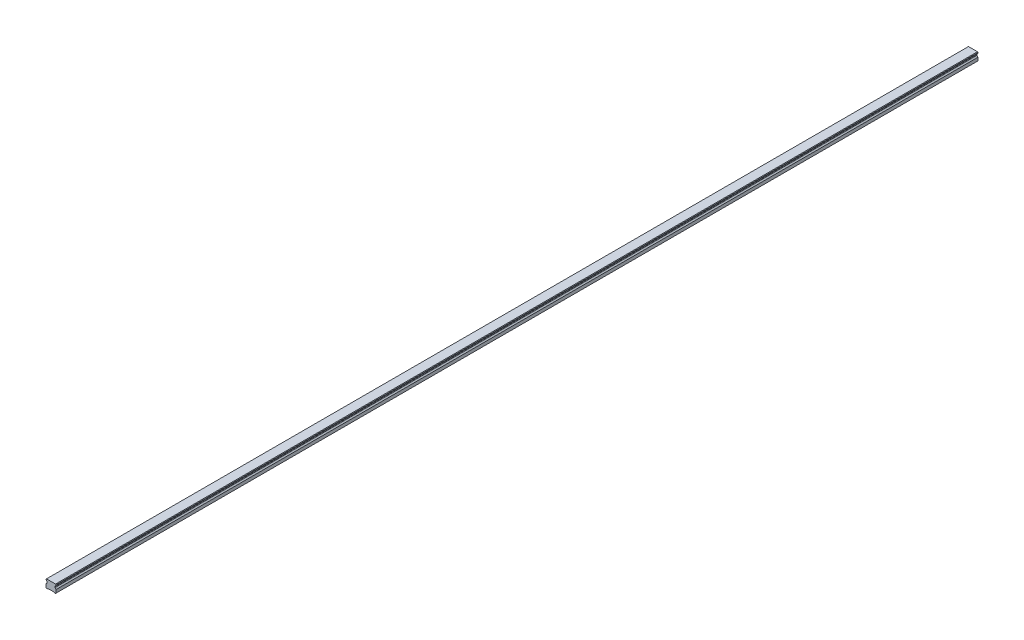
from build123d import *

# Parameters (mm, degrees)
SKETCH1_W           = 20
SKETCH1_H           = 16.3
BOSS_EXTRUDE1_DEPTH = 920
CUT_EXTRUDE1_DEPTH  = 1841.099369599
CHAMFER1_SIZE       = 1
FILLET1_R           = 1
CUT_EXTRUDE2_DEPTH  = 1841.099369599
SKETCH5_R           = 3
SKETCH5_R_2         = 2.5
CUT_EXTRUDE5_DEPTH  = 10
SKETCH5_2_R         = 2.5
CUT_EXTRUDE6_DEPTH  = 13
LPATTERN2_COUNT     = 31
LPATTERN2_PITCH     = 60


with BuildPart() as part:
    # Sketch1 → Boss-Extrude1 (new, symmetric)
    with BuildSketch(Plane.XY):
        with Locations((0, 8.15)):
            Rectangle(SKETCH1_W, SKETCH1_H)
    extrude(amount=BOSS_EXTRUDE1_DEPTH, both=True)

    # Sketch2 → Cut-Extrude1 (cut, through all)
    with BuildSketch(Plane.XY.offset(920)):
        Polygon((-10, 14.3), (-10, 7.3), (-7.666666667, 9.633333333), (-7.666666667, 11.966666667), align=None)
        Polygon((7.666666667, 11.966666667), (10, 14.3), (10, 7.3), (7.666666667, 9.633333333), align=None)
    extrude(amount=-CUT_EXTRUDE1_DEPTH, mode=Mode.SUBTRACT)

    # Chamfer1
    chamfer1_edges = [part.edges().sort_by_distance(p)[0] for p in [
        (-10, 16.3, 0),
        (10, 16.3, 0),
        (10, 0, 0),
        (-10, 0, 0),
    ]]
    chamfer(chamfer1_edges, length=CHAMFER1_SIZE)

    # Fillet1
    fillet1_edges = [part.edges().sort_by_distance(p)[0] for p in [
        (-7.666666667, 11.966666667, 0),
        (-7.666666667, 9.633333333, 0),
        (7.666666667, 9.633333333, 0),
        (7.666666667, 11.966666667, 0),
    ]]
    fillet(fillet1_edges, radius=FILLET1_R)

    # Sketch3 → Cut-Extrude2 (cut, through all)
    with BuildSketch(Plane.XY.offset(920)):
        Polygon((-6, 0), (-5, 1), (5, 1), (6, 0), align=None)
    extrude(amount=-CUT_EXTRUDE2_DEPTH, mode=Mode.SUBTRACT)

    # Sketch5 → Cut-Extrude5 (cut)
    with BuildSketch(Plane.XZ.offset(-1)):
        with Locations(Location((0, 900, 0), (0, 0, 270))):
            Circle(SKETCH5_R)
        with Locations(Location((0, 900, 0), (0, 0, 270))):
            Circle(SKETCH5_R_2, mode=Mode.SUBTRACT)
    cut_extrude5 = extrude(amount=-CUT_EXTRUDE5_DEPTH, mode=Mode.SUBTRACT)

    # Sketch5_2 → Cut-Extrude6 (cut)
    with BuildSketch(Plane.XZ.offset(-1)):
        with Locations(Location((0, 900, 0), (0, 0, 270))):
            Circle(SKETCH5_2_R)
    cut_extrude6 = extrude(amount=-CUT_EXTRUDE6_DEPTH, mode=Mode.SUBTRACT)

    # Cut-Extrude7 cone 1 section (on through the dimple's axis) → Cut-Extrude7 (revolve, cut)
    with BuildSketch(Plane(origin=(0, 14, 900), x_dir=(0, 0, -1), z_dir=(1, 0, 0))):
        Polygon((0, 0), (2.5, 0), (0, 1.443375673), align=None)
    cut_extrude7 = revolve(axis=Axis((0, 14, 900), (0, 1, 0)), mode=Mode.SUBTRACT)

    # LPattern2: Cut-Extrude5, Cut-Extrude6, Cut-Extrude7 ×31
    with Locations(*[(0, 0, -i * LPATTERN2_PITCH) for i in range(1, LPATTERN2_COUNT)]):
        add(cut_extrude5, mode=Mode.SUBTRACT)
        add(cut_extrude6, mode=Mode.SUBTRACT)
        add(cut_extrude7, mode=Mode.SUBTRACT)


solid = part.part
